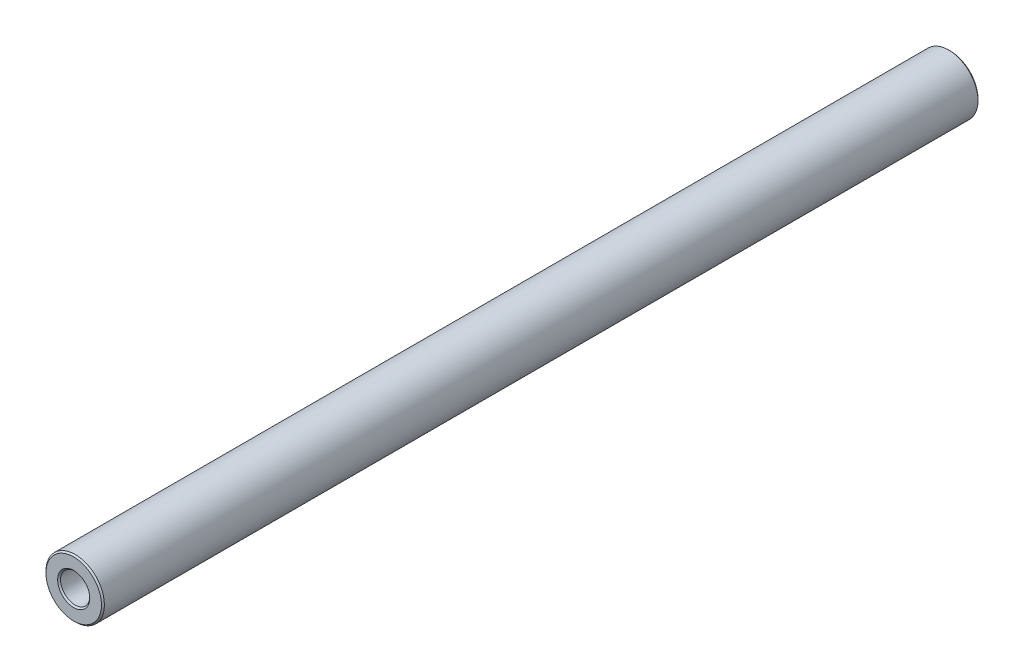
ISO-10303-21;
HEADER;
FILE_DESCRIPTION(('STEP AP214'),'2;1');
FILE_NAME('part.step','',(''),(''),'','','');
FILE_SCHEMA(('AUTOMOTIVE_DESIGN { 1 0 10303 214 1 1 1 1 }'));
ENDSEC;
DATA;
#1=APPLICATION_CONTEXT('core data for automotive mechanical design processes');
#2=APPLICATION_PROTOCOL_DEFINITION('international standard','automotive_design',2000,#1);
#3=PRODUCT_CONTEXT('',#1,'mechanical');
#4=PRODUCT('Part','Part','',(#3));
#5=PRODUCT_RELATED_PRODUCT_CATEGORY('part','',(#4));
#6=PRODUCT_DEFINITION_FORMATION('','',#4);
#7=PRODUCT_DEFINITION_CONTEXT('part definition',#1,'design');
#8=PRODUCT_DEFINITION('design','',#6,#7);
#9=PRODUCT_DEFINITION_SHAPE('','',#8);
#10=(LENGTH_UNIT() NAMED_UNIT(*) SI_UNIT(.MILLI.,.METRE.));
#11=(NAMED_UNIT(*) PLANE_ANGLE_UNIT() SI_UNIT($,.RADIAN.));
#12=(NAMED_UNIT(*) SI_UNIT($,.STERADIAN.) SOLID_ANGLE_UNIT());
#13=UNCERTAINTY_MEASURE_WITH_UNIT(LENGTH_MEASURE(1.E-05),#10,'distance_accuracy_value','');
#14=(GEOMETRIC_REPRESENTATION_CONTEXT(3) GLOBAL_UNCERTAINTY_ASSIGNED_CONTEXT((#13)) GLOBAL_UNIT_ASSIGNED_CONTEXT((#10,
#11,#12)) REPRESENTATION_CONTEXT('',''));
#15=CARTESIAN_POINT('',(0.,0.,0.));
#16=DIRECTION('',(0.,0.,1.));
#17=DIRECTION('',(1.,0.,0.));
#18=AXIS2_PLACEMENT_3D('',#15,#16,#17);
#19=CARTESIAN_POINT('',(0.,0.,75.));
#20=DIRECTION('',(0.,0.,1.));
#21=DIRECTION('',(1.,0.,0.));
#22=AXIS2_PLACEMENT_3D('',#19,#20,#21);
#23=PLANE('',#22);
#24=CARTESIAN_POINT('',(0.,0.,75.));
#25=DIRECTION('',(0.,0.,1.));
#26=DIRECTION('',(1.,0.,0.));
#27=AXIS2_PLACEMENT_3D('',#24,#25,#26);
#28=CIRCLE('',#27,2.75000000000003);
#29=CARTESIAN_POINT('',(2.75000000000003,0.,75.));
#30=VERTEX_POINT('',#29);
#31=EDGE_CURVE('E52',#30,#30,#28,.F.);
#32=ORIENTED_EDGE('',*,*,#31,.T.);
#33=EDGE_LOOP('',(#32));
#34=FACE_BOUND('',#33,.T.);
#35=CARTESIAN_POINT('',(0.,0.,75.));
#36=DIRECTION('',(0.,0.,1.));
#37=DIRECTION('',(1.,0.,0.));
#38=AXIS2_PLACEMENT_3D('',#35,#36,#37);
#39=CIRCLE('',#38,4.75);
#40=CARTESIAN_POINT('',(4.75,0.,75.));
#41=VERTEX_POINT('',#40);
#42=EDGE_CURVE('E58',#41,#41,#39,.T.);
#43=ORIENTED_EDGE('',*,*,#42,.T.);
#44=EDGE_LOOP('',(#43));
#45=FACE_BOUND('',#44,.T.);
#46=ADVANCED_FACE('F37',(#34,#45),#23,.T.);
#47=CARTESIAN_POINT('',(0.,0.,-75.));
#48=DIRECTION('',(0.,0.,1.));
#49=DIRECTION('',(1.,0.,0.));
#50=AXIS2_PLACEMENT_3D('',#47,#48,#49);
#51=PLANE('',#50);
#52=CARTESIAN_POINT('',(0.,0.,-75.));
#53=DIRECTION('',(0.,0.,1.));
#54=DIRECTION('',(1.,0.,0.));
#55=AXIS2_PLACEMENT_3D('',#52,#53,#54);
#56=CIRCLE('',#55,2.74999999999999);
#57=CARTESIAN_POINT('',(2.74999999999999,0.,-75.));
#58=VERTEX_POINT('',#57);
#59=EDGE_CURVE('E71',#58,#58,#56,.T.);
#60=ORIENTED_EDGE('',*,*,#59,.T.);
#61=EDGE_LOOP('',(#60));
#62=FACE_BOUND('',#61,.T.);
#63=CARTESIAN_POINT('',(0.,0.,-75.));
#64=DIRECTION('',(0.,0.,1.));
#65=DIRECTION('',(1.,0.,0.));
#66=AXIS2_PLACEMENT_3D('',#63,#64,#65);
#67=CIRCLE('',#66,4.74999999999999);
#68=CARTESIAN_POINT('',(4.74999999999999,0.,-75.));
#69=VERTEX_POINT('',#68);
#70=EDGE_CURVE('E74',#69,#69,#67,.F.);
#71=ORIENTED_EDGE('',*,*,#70,.T.);
#72=EDGE_LOOP('',(#71));
#73=FACE_BOUND('',#72,.T.);
#74=ADVANCED_FACE('F78',(#62,#73),#51,.F.);
#75=CARTESIAN_POINT('',(0.,0.,75.));
#76=DIRECTION('',(0.,0.,-1.));
#77=DIRECTION('',(-1.,0.,0.));
#78=AXIS2_PLACEMENT_3D('',#75,#76,#77);
#79=CYLINDRICAL_SURFACE('',#78,5.);
#80=CARTESIAN_POINT('',(0.,0.,-74.75));
#81=DIRECTION('',(0.,0.,1.));
#82=DIRECTION('',(1.,0.,0.));
#83=AXIS2_PLACEMENT_3D('',#80,#81,#82);
#84=CIRCLE('',#83,5.);
#85=CARTESIAN_POINT('',(5.,0.,-74.75));
#86=VERTEX_POINT('',#85);
#87=EDGE_CURVE('E10',#86,#86,#84,.T.);
#88=ORIENTED_EDGE('',*,*,#87,.T.);
#89=EDGE_LOOP('',(#88));
#90=FACE_BOUND('',#89,.T.);
#91=CARTESIAN_POINT('',(0.,0.,74.75));
#92=DIRECTION('',(0.,0.,1.));
#93=DIRECTION('',(1.,0.,0.));
#94=AXIS2_PLACEMENT_3D('',#91,#92,#93);
#95=CIRCLE('',#94,5.);
#96=CARTESIAN_POINT('',(5.,0.,74.75));
#97=VERTEX_POINT('',#96);
#98=EDGE_CURVE('E45',#97,#97,#95,.F.);
#99=ORIENTED_EDGE('',*,*,#98,.T.);
#100=EDGE_LOOP('',(#99));
#101=FACE_BOUND('',#100,.T.);
#102=ADVANCED_FACE('F98',(#90,#101),#79,.T.);
#103=CARTESIAN_POINT('',(0.,0.,75.));
#104=DIRECTION('',(0.,0.,-1.));
#105=DIRECTION('',(-1.,0.,0.));
#106=AXIS2_PLACEMENT_3D('',#103,#104,#105);
#107=CYLINDRICAL_SURFACE('',#106,2.5);
#108=CARTESIAN_POINT('',(0.,0.,-74.75));
#109=DIRECTION('',(0.,0.,1.));
#110=DIRECTION('',(1.,0.,0.));
#111=AXIS2_PLACEMENT_3D('',#108,#109,#110);
#112=CIRCLE('',#111,2.5);
#113=CARTESIAN_POINT('',(2.5,0.,-74.75));
#114=VERTEX_POINT('',#113);
#115=EDGE_CURVE('E64',#114,#114,#112,.F.);
#116=ORIENTED_EDGE('',*,*,#115,.T.);
#117=EDGE_LOOP('',(#116));
#118=FACE_BOUND('',#117,.T.);
#119=CARTESIAN_POINT('',(0.,0.,74.75));
#120=DIRECTION('',(0.,0.,1.));
#121=DIRECTION('',(1.,0.,0.));
#122=AXIS2_PLACEMENT_3D('',#119,#120,#121);
#123=CIRCLE('',#122,2.5);
#124=CARTESIAN_POINT('',(2.5,0.,74.75));
#125=VERTEX_POINT('',#124);
#126=EDGE_CURVE('E68',#125,#125,#123,.T.);
#127=ORIENTED_EDGE('',*,*,#126,.T.);
#128=EDGE_LOOP('',(#127));
#129=FACE_BOUND('',#128,.T.);
#130=ADVANCED_FACE('F103',(#118,#129),#107,.F.);
#131=CARTESIAN_POINT('',(0.,0.,-75.));
#132=DIRECTION('',(0.,0.,-1.));
#133=DIRECTION('',(-1.,0.,0.));
#134=AXIS2_PLACEMENT_3D('',#131,#132,#133);
#135=CONICAL_SURFACE('',#134,2.74999999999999,0.785398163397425);
#136=ORIENTED_EDGE('',*,*,#115,.F.);
#137=EDGE_LOOP('',(#136));
#138=FACE_BOUND('',#137,.T.);
#139=ORIENTED_EDGE('',*,*,#59,.F.);
#140=EDGE_LOOP('',(#139));
#141=FACE_BOUND('',#140,.T.);
#142=ADVANCED_FACE('F89',(#138,#141),#135,.F.);
#143=CARTESIAN_POINT('',(0.,0.,74.75));
#144=DIRECTION('',(0.,0.,1.));
#145=DIRECTION('',(1.,0.,0.));
#146=AXIS2_PLACEMENT_3D('',#143,#144,#145);
#147=CONICAL_SURFACE('',#146,2.5,0.785398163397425);
#148=ORIENTED_EDGE('',*,*,#31,.F.);
#149=EDGE_LOOP('',(#148));
#150=FACE_BOUND('',#149,.T.);
#151=ORIENTED_EDGE('',*,*,#126,.F.);
#152=EDGE_LOOP('',(#151));
#153=FACE_BOUND('',#152,.T.);
#154=ADVANCED_FACE('F83',(#150,#153),#147,.F.);
#155=CARTESIAN_POINT('',(0.,0.,-74.75));
#156=DIRECTION('',(0.,0.,1.));
#157=DIRECTION('',(1.,0.,0.));
#158=AXIS2_PLACEMENT_3D('',#155,#156,#157);
#159=CONICAL_SURFACE('',#158,5.,0.785398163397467);
#160=ORIENTED_EDGE('',*,*,#70,.F.);
#161=EDGE_LOOP('',(#160));
#162=FACE_BOUND('',#161,.T.);
#163=ORIENTED_EDGE('',*,*,#87,.F.);
#164=EDGE_LOOP('',(#163));
#165=FACE_BOUND('',#164,.T.);
#166=ADVANCED_FACE('F80',(#162,#165),#159,.T.);
#167=CARTESIAN_POINT('',(0.,0.,75.));
#168=DIRECTION('',(0.,0.,-1.));
#169=DIRECTION('',(-1.,0.,0.));
#170=AXIS2_PLACEMENT_3D('',#167,#168,#169);
#171=CONICAL_SURFACE('',#170,4.75,0.78539816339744);
#172=ORIENTED_EDGE('',*,*,#98,.F.);
#173=EDGE_LOOP('',(#172));
#174=FACE_BOUND('',#173,.T.);
#175=ORIENTED_EDGE('',*,*,#42,.F.);
#176=EDGE_LOOP('',(#175));
#177=FACE_BOUND('',#176,.T.);
#178=ADVANCED_FACE('F39',(#174,#177),#171,.T.);
#179=CLOSED_SHELL('',(#46,#74,#102,#130,#142,#154,#166,#178));
#180=MANIFOLD_SOLID_BREP('B2',#179);
#181=ADVANCED_BREP_SHAPE_REPRESENTATION('',(#18,#180),#14);
#182=SHAPE_DEFINITION_REPRESENTATION(#9,#181);
ENDSEC;
END-ISO-10303-21;
